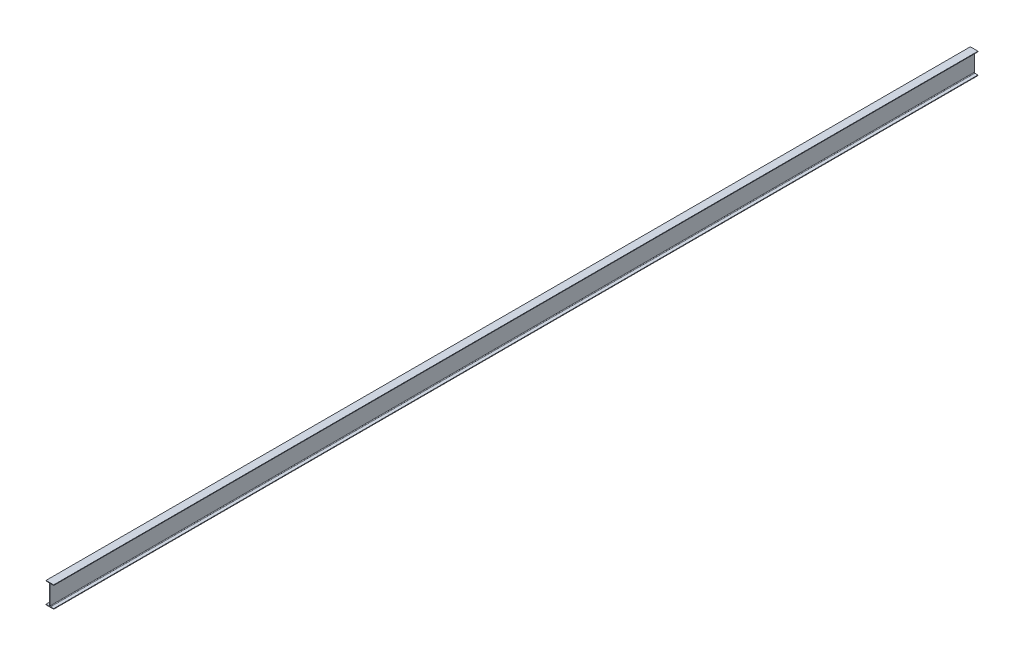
from build123d import *

# Parameters (mm, degrees)
BOSS_EXTRUDE1_DEPTH = 7632.7


with BuildPart() as part:
    # Sketch1 → Boss-Extrude1 (new, symmetric)
    with BuildSketch(Plane.XY):
        with BuildLine():
            Line((-63.5, -174.498), (-63.5, -165.989))
            Line((-63.5, -165.989), (-13.081, -165.989))
            ThreePointArc((-13.081, -165.989), (-5.896795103, -163.013204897), (-2.921, -155.829))
            Line((-2.921, -155.829), (-2.921, 155.829))
            ThreePointArc((-2.921, 155.829), (-5.896795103, 163.013204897), (-13.081, 165.989))
            Line((-13.081, 165.989), (-63.5, 165.989))
            Line((-63.5, 165.989), (-63.5, 174.498))
            Line((-63.5, 174.498), (63.5, 174.498))
            Line((63.5, 174.498), (63.5, 165.989))
            Line((63.5, 165.989), (13.081, 165.989))
            ThreePointArc((13.081, 165.989), (5.896795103, 163.013204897), (2.921, 155.829))
            Line((2.921, 155.829), (2.921, -155.829))
            ThreePointArc((2.921, -155.829), (5.896795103, -163.013204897), (13.081, -165.989))
            Line((13.081, -165.989), (63.5, -165.989))
            Line((63.5, -165.989), (63.5, -174.498))
            Line((63.5, -174.498), (-63.5, -174.498))
        make_face()
    extrude(amount=BOSS_EXTRUDE1_DEPTH, both=True)


solid = part.part
